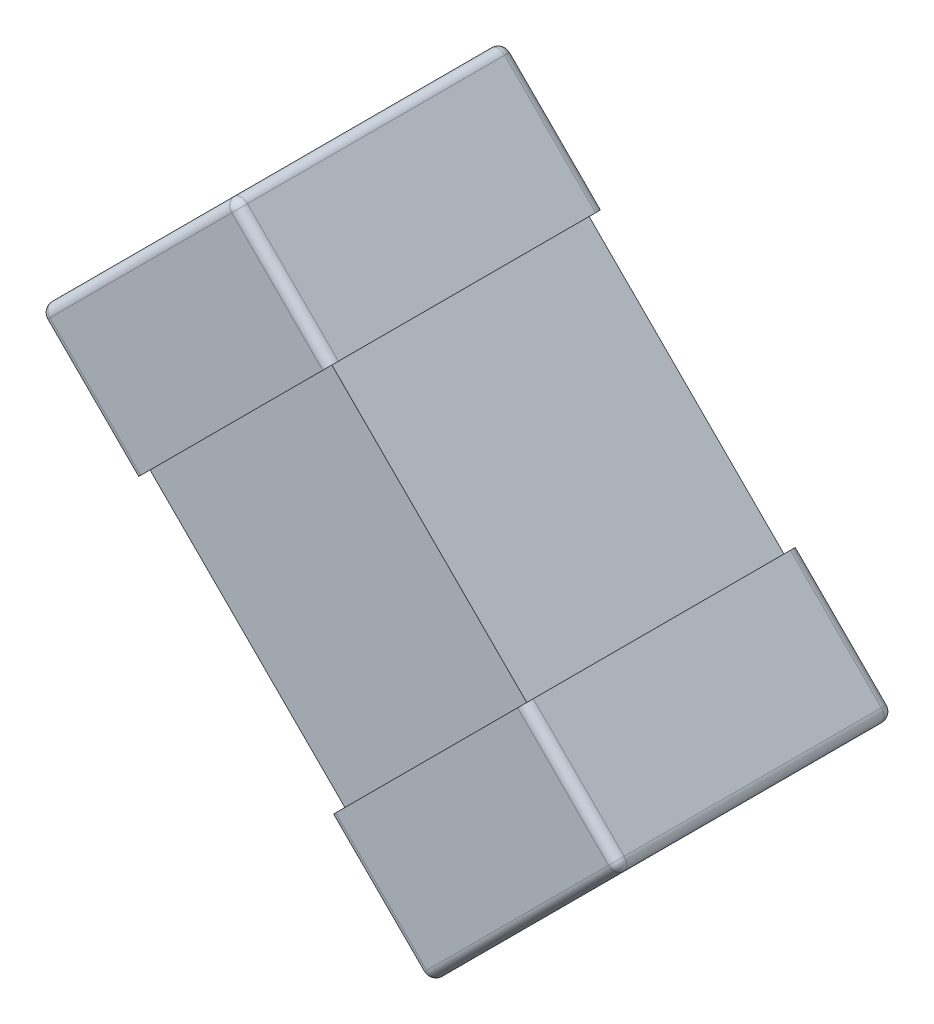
ISO-10303-21;
HEADER;
FILE_DESCRIPTION(('STEP AP214'),'2;1');
FILE_NAME('part.step','',(''),(''),'','','');
FILE_SCHEMA(('AUTOMOTIVE_DESIGN { 1 0 10303 214 1 1 1 1 }'));
ENDSEC;
DATA;
#1=APPLICATION_CONTEXT('core data for automotive mechanical design processes');
#2=APPLICATION_PROTOCOL_DEFINITION('international standard','automotive_design',2000,#1);
#3=PRODUCT_CONTEXT('',#1,'mechanical');
#4=PRODUCT('Part','Part','',(#3));
#5=PRODUCT_RELATED_PRODUCT_CATEGORY('part','',(#4));
#6=PRODUCT_DEFINITION_FORMATION('','',#4);
#7=PRODUCT_DEFINITION_CONTEXT('part definition',#1,'design');
#8=PRODUCT_DEFINITION('design','',#6,#7);
#9=PRODUCT_DEFINITION_SHAPE('','',#8);
#10=(LENGTH_UNIT() NAMED_UNIT(*) SI_UNIT(.MILLI.,.METRE.));
#11=(NAMED_UNIT(*) PLANE_ANGLE_UNIT() SI_UNIT($,.RADIAN.));
#12=(NAMED_UNIT(*) SI_UNIT($,.STERADIAN.) SOLID_ANGLE_UNIT());
#13=UNCERTAINTY_MEASURE_WITH_UNIT(LENGTH_MEASURE(1.E-05),#10,'distance_accuracy_value','');
#14=(GEOMETRIC_REPRESENTATION_CONTEXT(3) GLOBAL_UNCERTAINTY_ASSIGNED_CONTEXT((#13)) GLOBAL_UNIT_ASSIGNED_CONTEXT((#10,
#11,#12)) REPRESENTATION_CONTEXT('',''));
#15=CARTESIAN_POINT('',(0.,0.,0.));
#16=DIRECTION('',(0.,0.,1.));
#17=DIRECTION('',(1.,0.,0.));
#18=AXIS2_PLACEMENT_3D('',#15,#16,#17);
#19=CARTESIAN_POINT('',(12.036066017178,8.84180194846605,0.01));
#20=DIRECTION('',(-0.707106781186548,0.707106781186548,0.));
#21=DIRECTION('',(-0.707106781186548,-0.707106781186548,0.));
#22=AXIS2_PLACEMENT_3D('',#19,#20,#21);
#23=PLANE('',#22);
#24=DIRECTION('',(0.,0.,-1.));
#25=VECTOR('',#24,1.);
#26=CARTESIAN_POINT('',(12.2411269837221,9.04686291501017,0.01));
#27=LINE('',#26,#25);
#28=CARTESIAN_POINT('',(12.2411269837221,9.04686291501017,0.3));
#29=VERTEX_POINT('',#28);
#30=CARTESIAN_POINT('',(12.2411269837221,9.04686291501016,0.0199999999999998));
#31=VERTEX_POINT('',#30);
#32=EDGE_CURVE('E414',#29,#31,#27,.T.);
#33=ORIENTED_EDGE('',*,*,#32,.F.);
#34=DIRECTION('',(-0.707106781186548,-0.707106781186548,0.));
#35=VECTOR('',#34,1.);
#36=CARTESIAN_POINT('',(12.036066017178,8.84180194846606,0.3));
#37=LINE('',#36,#35);
#38=CARTESIAN_POINT('',(12.0431370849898,8.84887301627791,0.3));
#39=VERTEX_POINT('',#38);
#40=EDGE_CURVE('E516',#39,#29,#37,.F.);
#41=ORIENTED_EDGE('',*,*,#40,.F.);
#42=DIRECTION('',(0.,0.,1.));
#43=VECTOR('',#42,1.);
#44=CARTESIAN_POINT('',(12.0431370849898,8.84887301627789,0.31));
#45=LINE('',#44,#43);
#46=CARTESIAN_POINT('',(12.0431370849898,8.8488730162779,0.0200000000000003));
#47=VERTEX_POINT('',#46);
#48=EDGE_CURVE('E447',#47,#39,#45,.T.);
#49=ORIENTED_EDGE('',*,*,#48,.F.);
#50=DIRECTION('',(-0.707106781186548,-0.707106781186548,0.));
#51=VECTOR('',#50,1.);
#52=CARTESIAN_POINT('',(12.036066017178,8.84180194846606,0.02));
#53=LINE('',#52,#51);
#54=EDGE_CURVE('E507',#31,#47,#53,.T.);
#55=ORIENTED_EDGE('',*,*,#54,.F.);
#56=EDGE_LOOP('',(#33,#41,#49,#55));
#57=FACE_BOUND('',#56,.T.);
#58=ADVANCED_FACE('F17',(#57),#23,.F.);
#59=CARTESIAN_POINT('',(11.6118019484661,9.26606601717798,0.01));
#60=DIRECTION('',(0.707106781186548,-0.707106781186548,0.));
#61=DIRECTION('',(0.707106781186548,0.707106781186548,0.));
#62=AXIS2_PLACEMENT_3D('',#59,#60,#61);
#63=PLANE('',#62);
#64=DIRECTION('',(0.,0.,1.));
#65=VECTOR('',#64,1.);
#66=CARTESIAN_POINT('',(11.6188730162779,9.27313708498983,0.31));
#67=LINE('',#66,#65);
#68=CARTESIAN_POINT('',(11.6188730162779,9.27313708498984,0.3));
#69=VERTEX_POINT('',#68);
#70=CARTESIAN_POINT('',(11.6188730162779,9.27313708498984,0.0200000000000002));
#71=VERTEX_POINT('',#70);
#72=EDGE_CURVE('E364',#69,#71,#67,.F.);
#73=ORIENTED_EDGE('',*,*,#72,.F.);
#74=DIRECTION('',(-0.707106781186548,-0.707106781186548,0.));
#75=VECTOR('',#74,1.);
#76=CARTESIAN_POINT('',(11.611801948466,9.26606601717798,0.3));
#77=LINE('',#76,#75);
#78=CARTESIAN_POINT('',(11.8168629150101,9.4711269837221,0.3));
#79=VERTEX_POINT('',#78);
#80=EDGE_CURVE('E488',#79,#69,#77,.T.);
#81=ORIENTED_EDGE('',*,*,#80,.F.);
#82=DIRECTION('',(0.,0.,-1.));
#83=VECTOR('',#82,1.);
#84=CARTESIAN_POINT('',(11.8168629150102,9.47112698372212,0.01));
#85=LINE('',#84,#83);
#86=CARTESIAN_POINT('',(11.8168629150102,9.47112698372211,0.02));
#87=VERTEX_POINT('',#86);
#88=EDGE_CURVE('E304',#87,#79,#85,.F.);
#89=ORIENTED_EDGE('',*,*,#88,.F.);
#90=DIRECTION('',(-0.707106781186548,-0.707106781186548,0.));
#91=VECTOR('',#90,1.);
#92=CARTESIAN_POINT('',(11.611801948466,9.26606601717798,0.02));
#93=LINE('',#92,#91);
#94=EDGE_CURVE('E497',#71,#87,#93,.F.);
#95=ORIENTED_EDGE('',*,*,#94,.F.);
#96=EDGE_LOOP('',(#73,#81,#89,#95));
#97=FACE_BOUND('',#96,.T.);
#98=ADVANCED_FACE('F477',(#97),#63,.F.);
#99=CARTESIAN_POINT('',(12.2340559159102,9.05393398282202,0.3));
#100=DIRECTION('',(-0.707106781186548,0.707106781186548,0.));
#101=DIRECTION('',(0.,0.,-1.));
#102=AXIS2_PLACEMENT_3D('',#99,#100,#101);
#103=SPHERICAL_SURFACE('',#102,0.01);
#104=CARTESIAN_POINT('',(12.2340559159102,9.05393398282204,0.3));
#105=DIRECTION('',(-0.707106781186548,-0.707106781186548,0.));
#106=DIRECTION('',(0.707106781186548,-0.707106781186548,0.));
#107=AXIS2_PLACEMENT_3D('',#104,#105,#106);
#108=CIRCLE('',#107,0.01);
#109=CARTESIAN_POINT('',(12.2340559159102,9.05393398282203,0.31));
#110=VERTEX_POINT('',#109);
#111=EDGE_CURVE('E519',#29,#110,#108,.T.);
#112=ORIENTED_EDGE('',*,*,#111,.F.);
#113=CARTESIAN_POINT('',(12.2340559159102,9.05393398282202,0.3));
#114=DIRECTION('',(0.,0.,-1.));
#115=DIRECTION('',(-1.,0.,0.));
#116=AXIS2_PLACEMENT_3D('',#113,#114,#115);
#117=CIRCLE('',#116,0.01);
#118=CARTESIAN_POINT('',(12.2411269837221,9.06100505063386,0.3));
#119=VERTEX_POINT('',#118);
#120=EDGE_CURVE('E401',#119,#29,#117,.T.);
#121=ORIENTED_EDGE('',*,*,#120,.F.);
#122=CARTESIAN_POINT('',(12.2340559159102,9.05393398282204,0.3));
#123=DIRECTION('',(0.707106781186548,-0.707106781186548,0.));
#124=DIRECTION('',(0.707106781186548,0.707106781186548,0.));
#125=AXIS2_PLACEMENT_3D('',#122,#123,#124);
#126=CIRCLE('',#125,0.01);
#127=EDGE_CURVE('E196',#110,#119,#126,.F.);
#128=ORIENTED_EDGE('',*,*,#127,.F.);
#129=EDGE_LOOP('',(#112,#121,#128));
#130=FACE_BOUND('',#129,.T.);
#131=ADVANCED_FACE('F473',(#130),#103,.T.);
#132=CARTESIAN_POINT('',(12.0289949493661,8.84887301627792,0.3));
#133=DIRECTION('',(-0.707106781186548,-0.707106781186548,0.));
#134=DIRECTION('',(0.707106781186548,-0.707106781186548,0.));
#135=AXIS2_PLACEMENT_3D('',#132,#133,#134);
#136=CYLINDRICAL_SURFACE('',#135,0.01);
#137=ORIENTED_EDGE('',*,*,#111,.T.);
#138=DIRECTION('',(-0.707106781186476,-0.707106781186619,0.));
#139=VECTOR('',#138,1.);
#140=CARTESIAN_POINT('',(12.2340559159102,9.05393398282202,0.31));
#141=LINE('',#140,#139);
#142=CARTESIAN_POINT('',(12.0360660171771,8.85594408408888,0.31));
#143=VERTEX_POINT('',#142);
#144=EDGE_CURVE('E195',#110,#143,#141,.T.);
#145=ORIENTED_EDGE('',*,*,#144,.T.);
#146=CARTESIAN_POINT('',(12.036066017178,8.85594408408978,0.3));
#147=DIRECTION('',(0.707106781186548,0.707106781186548,5.16518506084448E-10));
#148=DIRECTION('',(-0.707106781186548,0.707106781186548,0.));
#149=AXIS2_PLACEMENT_3D('',#146,#147,#148);
#150=CIRCLE('',#149,0.01);
#151=EDGE_CURVE('E457',#39,#143,#150,.F.);
#152=ORIENTED_EDGE('',*,*,#151,.F.);
#153=ORIENTED_EDGE('',*,*,#40,.T.);
#154=EDGE_LOOP('',(#137,#145,#152,#153));
#155=FACE_BOUND('',#154,.T.);
#156=ADVANCED_FACE('F469',(#155),#136,.T.);
#157=CARTESIAN_POINT('',(12.036066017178,8.85594408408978,0.3));
#158=DIRECTION('',(-0.707106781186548,0.707106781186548,0.));
#159=DIRECTION('',(0.,0.,-1.));
#160=AXIS2_PLACEMENT_3D('',#157,#158,#159);
#161=SPHERICAL_SURFACE('',#160,0.01);
#162=CARTESIAN_POINT('',(12.036066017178,8.85594408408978,0.3));
#163=DIRECTION('',(0.,0.,1.));
#164=DIRECTION('',(1.,0.,0.));
#165=AXIS2_PLACEMENT_3D('',#162,#163,#164);
#166=CIRCLE('',#165,0.01);
#167=CARTESIAN_POINT('',(12.0289949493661,8.84887301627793,0.3));
#168=VERTEX_POINT('',#167);
#169=EDGE_CURVE('E454',#39,#168,#166,.F.);
#170=ORIENTED_EDGE('',*,*,#169,.F.);
#171=ORIENTED_EDGE('',*,*,#151,.T.);
#172=CARTESIAN_POINT('',(12.0360660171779,8.85594408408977,0.3));
#173=DIRECTION('',(-0.707106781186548,0.707106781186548,0.));
#174=DIRECTION('',(-0.707106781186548,-0.707106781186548,0.));
#175=AXIS2_PLACEMENT_3D('',#172,#173,#174);
#176=CIRCLE('',#175,0.01);
#177=EDGE_CURVE('E292',#168,#143,#176,.T.);
#178=ORIENTED_EDGE('',*,*,#177,.F.);
#179=EDGE_LOOP('',(#170,#171,#178));
#180=FACE_BOUND('',#179,.T.);
#181=ADVANCED_FACE('F466',(#180),#161,.T.);
#182=CARTESIAN_POINT('',(12.036066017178,8.85594408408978,0.31));
#183=DIRECTION('',(0.,0.,1.));
#184=DIRECTION('',(1.,0.,0.));
#185=AXIS2_PLACEMENT_3D('',#182,#183,#184);
#186=CYLINDRICAL_SURFACE('',#185,0.01);
#187=CARTESIAN_POINT('',(12.036066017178,8.85594408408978,0.0200000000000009));
#188=DIRECTION('',(0.,0.,1.));
#189=DIRECTION('',(-0.707106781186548,0.707106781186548,0.));
#190=AXIS2_PLACEMENT_3D('',#187,#188,#189);
#191=CIRCLE('',#190,0.01);
#192=CARTESIAN_POINT('',(12.0289949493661,8.84887301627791,0.0200000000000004));
#193=VERTEX_POINT('',#192);
#194=EDGE_CURVE('E443',#47,#193,#191,.F.);
#195=ORIENTED_EDGE('',*,*,#194,.F.);
#196=ORIENTED_EDGE('',*,*,#48,.T.);
#197=ORIENTED_EDGE('',*,*,#169,.T.);
#198=DIRECTION('',(0.,0.,1.));
#199=VECTOR('',#198,1.);
#200=CARTESIAN_POINT('',(12.0289949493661,8.84887301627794,0.31));
#201=LINE('',#200,#199);
#202=EDGE_CURVE('E287',#193,#168,#201,.T.);
#203=ORIENTED_EDGE('',*,*,#202,.F.);
#204=EDGE_LOOP('',(#195,#196,#197,#203));
#205=FACE_BOUND('',#204,.T.);
#206=ADVANCED_FACE('F435',(#205),#186,.T.);
#207=CARTESIAN_POINT('',(12.036066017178,8.85594408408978,0.02));
#208=DIRECTION('',(-0.707106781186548,0.707106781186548,0.));
#209=DIRECTION('',(0.,0.,-1.));
#210=AXIS2_PLACEMENT_3D('',#207,#208,#209);
#211=SPHERICAL_SURFACE('',#210,0.01);
#212=CARTESIAN_POINT('',(12.036066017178,8.85594408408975,0.0200000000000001));
#213=DIRECTION('',(0.707106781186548,-0.707106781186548,0.));
#214=DIRECTION('',(0.707106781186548,0.707106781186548,0.));
#215=AXIS2_PLACEMENT_3D('',#212,#213,#214);
#216=CIRCLE('',#215,0.01);
#217=CARTESIAN_POINT('',(12.036066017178,8.85594408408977,0.01));
#218=VERTEX_POINT('',#217);
#219=EDGE_CURVE('E281',#218,#193,#216,.F.);
#220=ORIENTED_EDGE('',*,*,#219,.F.);
#221=CARTESIAN_POINT('',(12.0360660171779,8.85594408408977,0.02));
#222=DIRECTION('',(-0.707106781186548,-0.707106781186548,0.));
#223=DIRECTION('',(0.707106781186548,-0.707106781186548,0.));
#224=AXIS2_PLACEMENT_3D('',#221,#222,#223);
#225=CIRCLE('',#224,0.01);
#226=EDGE_CURVE('E446',#47,#218,#225,.F.);
#227=ORIENTED_EDGE('',*,*,#226,.F.);
#228=ORIENTED_EDGE('',*,*,#194,.T.);
#229=EDGE_LOOP('',(#220,#227,#228));
#230=FACE_BOUND('',#229,.T.);
#231=ADVANCED_FACE('F430',(#230),#211,.T.);
#232=CARTESIAN_POINT('',(12.0289949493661,8.84887301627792,0.02));
#233=DIRECTION('',(-0.707106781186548,-0.707106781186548,0.));
#234=DIRECTION('',(0.707106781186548,-0.707106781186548,0.));
#235=AXIS2_PLACEMENT_3D('',#232,#233,#234);
#236=CYLINDRICAL_SURFACE('',#235,0.01);
#237=CARTESIAN_POINT('',(12.2340559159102,9.05393398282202,0.02));
#238=DIRECTION('',(-0.707106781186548,-0.707106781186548,0.));
#239=DIRECTION('',(-0.707106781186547,0.707106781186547,0.));
#240=AXIS2_PLACEMENT_3D('',#237,#238,#239);
#241=CIRCLE('',#240,0.01);
#242=CARTESIAN_POINT('',(12.2340559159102,9.05393398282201,0.01));
#243=VERTEX_POINT('',#242);
#244=EDGE_CURVE('E402',#31,#243,#241,.F.);
#245=ORIENTED_EDGE('',*,*,#244,.F.);
#246=ORIENTED_EDGE('',*,*,#54,.T.);
#247=ORIENTED_EDGE('',*,*,#226,.T.);
#248=DIRECTION('',(0.707106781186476,0.707106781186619,0.));
#249=VECTOR('',#248,1.);
#250=CARTESIAN_POINT('',(12.036066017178,8.85594408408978,0.01));
#251=LINE('',#250,#249);
#252=EDGE_CURVE('E275',#218,#243,#251,.T.);
#253=ORIENTED_EDGE('',*,*,#252,.T.);
#254=EDGE_LOOP('',(#245,#246,#247,#253));
#255=FACE_BOUND('',#254,.T.);
#256=ADVANCED_FACE('F426',(#255),#236,.T.);
#257=CARTESIAN_POINT('',(12.2340559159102,9.05393398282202,0.02));
#258=DIRECTION('',(-0.707106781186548,0.707106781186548,0.));
#259=DIRECTION('',(0.,0.,-1.));
#260=AXIS2_PLACEMENT_3D('',#257,#258,#259);
#261=SPHERICAL_SURFACE('',#260,0.01);
#262=CARTESIAN_POINT('',(12.2340559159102,9.05393398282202,0.02));
#263=DIRECTION('',(-0.707106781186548,0.707106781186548,0.));
#264=DIRECTION('',(-0.707106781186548,-0.707106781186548,0.));
#265=AXIS2_PLACEMENT_3D('',#262,#263,#264);
#266=CIRCLE('',#265,0.01);
#267=CARTESIAN_POINT('',(12.2411269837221,9.06100505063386,0.0199999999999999));
#268=VERTEX_POINT('',#267);
#269=EDGE_CURVE('E269',#268,#243,#266,.T.);
#270=ORIENTED_EDGE('',*,*,#269,.F.);
#271=CARTESIAN_POINT('',(12.2340559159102,9.05393398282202,0.02));
#272=DIRECTION('',(0.,0.,-1.));
#273=DIRECTION('',(-1.,0.,0.));
#274=AXIS2_PLACEMENT_3D('',#271,#272,#273);
#275=CIRCLE('',#274,0.01);
#276=EDGE_CURVE('E398',#31,#268,#275,.F.);
#277=ORIENTED_EDGE('',*,*,#276,.F.);
#278=ORIENTED_EDGE('',*,*,#244,.T.);
#279=EDGE_LOOP('',(#270,#277,#278));
#280=FACE_BOUND('',#279,.T.);
#281=ADVANCED_FACE('F423',(#280),#261,.T.);
#282=CARTESIAN_POINT('',(12.2340559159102,9.05393398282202,0.01));
#283=DIRECTION('',(0.,0.,-1.));
#284=DIRECTION('',(-1.,0.,0.));
#285=AXIS2_PLACEMENT_3D('',#282,#283,#284);
#286=CYLINDRICAL_SURFACE('',#285,0.01);
#287=ORIENTED_EDGE('',*,*,#120,.T.);
#288=ORIENTED_EDGE('',*,*,#32,.T.);
#289=ORIENTED_EDGE('',*,*,#276,.T.);
#290=DIRECTION('',(0.,0.,1.));
#291=VECTOR('',#290,1.);
#292=CARTESIAN_POINT('',(12.2411269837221,9.06100505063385,0.31));
#293=LINE('',#292,#291);
#294=EDGE_CURVE('E260',#268,#119,#293,.T.);
#295=ORIENTED_EDGE('',*,*,#294,.T.);
#296=EDGE_LOOP('',(#287,#288,#289,#295));
#297=FACE_BOUND('',#296,.T.);
#298=ADVANCED_FACE('F386',(#297),#286,.T.);
#299=CARTESIAN_POINT('',(11.823933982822,9.46405591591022,0.02));
#300=DIRECTION('',(0.707106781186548,-0.707106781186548,0.));
#301=DIRECTION('',(0.,0.,-1.));
#302=AXIS2_PLACEMENT_3D('',#299,#300,#301);
#303=SPHERICAL_SURFACE('',#302,0.01);
#304=CARTESIAN_POINT('',(11.823933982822,9.46405591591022,0.02));
#305=DIRECTION('',(0.,0.,-1.));
#306=DIRECTION('',(-1.,0.,0.));
#307=AXIS2_PLACEMENT_3D('',#304,#305,#306);
#308=CIRCLE('',#307,0.01);
#309=CARTESIAN_POINT('',(11.8310050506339,9.47112698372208,0.0199999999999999));
#310=VERTEX_POINT('',#309);
#311=EDGE_CURVE('E315',#310,#87,#308,.F.);
#312=ORIENTED_EDGE('',*,*,#311,.F.);
#313=CARTESIAN_POINT('',(11.823933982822,9.46405591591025,0.02));
#314=DIRECTION('',(0.707106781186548,-0.707106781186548,0.));
#315=DIRECTION('',(0.707106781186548,0.707106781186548,0.));
#316=AXIS2_PLACEMENT_3D('',#313,#314,#315);
#317=CIRCLE('',#316,0.01);
#318=CARTESIAN_POINT('',(11.823933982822,9.46405591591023,0.01));
#319=VERTEX_POINT('',#318);
#320=EDGE_CURVE('E254',#319,#310,#317,.T.);
#321=ORIENTED_EDGE('',*,*,#320,.F.);
#322=CARTESIAN_POINT('',(11.823933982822,9.46405591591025,0.02));
#323=DIRECTION('',(-0.707106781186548,-0.707106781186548,0.));
#324=DIRECTION('',(0.707106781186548,-0.707106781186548,0.));
#325=AXIS2_PLACEMENT_3D('',#322,#323,#324);
#326=CIRCLE('',#325,0.01);
#327=EDGE_CURVE('E500',#87,#319,#326,.T.);
#328=ORIENTED_EDGE('',*,*,#327,.F.);
#329=EDGE_LOOP('',(#312,#321,#328));
#330=FACE_BOUND('',#329,.T.);
#331=ADVANCED_FACE('F381',(#330),#303,.T.);
#332=CARTESIAN_POINT('',(11.6188730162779,9.25899494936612,0.02));
#333=DIRECTION('',(-0.707106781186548,-0.707106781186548,0.));
#334=DIRECTION('',(0.707106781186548,-0.707106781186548,0.));
#335=AXIS2_PLACEMENT_3D('',#332,#333,#334);
#336=CYLINDRICAL_SURFACE('',#335,0.01);
#337=ORIENTED_EDGE('',*,*,#327,.T.);
#338=DIRECTION('',(-0.707106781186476,-0.707106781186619,0.));
#339=VECTOR('',#338,1.);
#340=CARTESIAN_POINT('',(11.823933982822,9.46405591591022,0.01));
#341=LINE('',#340,#339);
#342=CARTESIAN_POINT('',(11.6259440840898,9.26606601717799,0.0100000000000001));
#343=VERTEX_POINT('',#342);
#344=EDGE_CURVE('E253',#319,#343,#341,.T.);
#345=ORIENTED_EDGE('',*,*,#344,.T.);
#346=CARTESIAN_POINT('',(11.6259440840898,9.26606601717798,0.02));
#347=DIRECTION('',(0.707106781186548,0.707106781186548,0.));
#348=DIRECTION('',(0.707106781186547,-0.707106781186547,0.));
#349=AXIS2_PLACEMENT_3D('',#346,#347,#348);
#350=CIRCLE('',#349,0.01);
#351=EDGE_CURVE('E372',#71,#343,#350,.F.);
#352=ORIENTED_EDGE('',*,*,#351,.F.);
#353=ORIENTED_EDGE('',*,*,#94,.T.);
#354=EDGE_LOOP('',(#337,#345,#352,#353));
#355=FACE_BOUND('',#354,.T.);
#356=ADVANCED_FACE('F377',(#355),#336,.T.);
#357=CARTESIAN_POINT('',(11.6259440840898,9.26606601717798,0.02));
#358=DIRECTION('',(0.707106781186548,-0.707106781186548,0.));
#359=DIRECTION('',(0.,0.,-1.));
#360=AXIS2_PLACEMENT_3D('',#357,#358,#359);
#361=SPHERICAL_SURFACE('',#360,0.01);
#362=ORIENTED_EDGE('',*,*,#351,.T.);
#363=CARTESIAN_POINT('',(11.6259440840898,9.26606601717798,0.0200000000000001));
#364=DIRECTION('',(-0.707106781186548,0.707106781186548,0.));
#365=DIRECTION('',(-0.707106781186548,-0.707106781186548,0.));
#366=AXIS2_PLACEMENT_3D('',#363,#364,#365);
#367=CIRCLE('',#366,0.01);
#368=CARTESIAN_POINT('',(11.6188730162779,9.25899494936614,0.02));
#369=VERTEX_POINT('',#368);
#370=EDGE_CURVE('E247',#369,#343,#367,.F.);
#371=ORIENTED_EDGE('',*,*,#370,.F.);
#372=CARTESIAN_POINT('',(11.6259440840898,9.26606601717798,0.02));
#373=DIRECTION('',(0.,0.,1.));
#374=DIRECTION('',(1.,0.,0.));
#375=AXIS2_PLACEMENT_3D('',#372,#373,#374);
#376=CIRCLE('',#375,0.01);
#377=EDGE_CURVE('E355',#71,#369,#376,.T.);
#378=ORIENTED_EDGE('',*,*,#377,.F.);
#379=EDGE_LOOP('',(#362,#371,#378));
#380=FACE_BOUND('',#379,.T.);
#381=ADVANCED_FACE('F374',(#380),#361,.T.);
#382=CARTESIAN_POINT('',(11.6259440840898,9.26606601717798,0.31));
#383=DIRECTION('',(0.,0.,1.));
#384=DIRECTION('',(1.,0.,0.));
#385=AXIS2_PLACEMENT_3D('',#382,#383,#384);
#386=CYLINDRICAL_SURFACE('',#385,0.01);
#387=ORIENTED_EDGE('',*,*,#377,.T.);
#388=DIRECTION('',(0.,0.,1.));
#389=VECTOR('',#388,1.);
#390=CARTESIAN_POINT('',(11.6188730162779,9.25899494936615,0.31));
#391=LINE('',#390,#389);
#392=CARTESIAN_POINT('',(11.6188730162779,9.25899494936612,0.299999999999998));
#393=VERTEX_POINT('',#392);
#394=EDGE_CURVE('E241',#393,#369,#391,.F.);
#395=ORIENTED_EDGE('',*,*,#394,.F.);
#396=CARTESIAN_POINT('',(11.6259440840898,9.26606601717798,0.3));
#397=DIRECTION('',(4.74675854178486E-13,4.74675854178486E-13,-1.));
#398=DIRECTION('',(0.707106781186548,-0.707106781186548,0.));
#399=AXIS2_PLACEMENT_3D('',#396,#397,#398);
#400=CIRCLE('',#399,0.01);
#401=EDGE_CURVE('E351',#69,#393,#400,.F.);
#402=ORIENTED_EDGE('',*,*,#401,.F.);
#403=ORIENTED_EDGE('',*,*,#72,.T.);
#404=EDGE_LOOP('',(#387,#395,#402,#403));
#405=FACE_BOUND('',#404,.T.);
#406=ADVANCED_FACE('F343',(#405),#386,.T.);
#407=CARTESIAN_POINT('',(11.6259440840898,9.26606601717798,0.3));
#408=DIRECTION('',(0.707106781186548,-0.707106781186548,0.));
#409=DIRECTION('',(0.,0.,-1.));
#410=AXIS2_PLACEMENT_3D('',#407,#408,#409);
#411=SPHERICAL_SURFACE('',#410,0.01);
#412=CARTESIAN_POINT('',(11.6259440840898,9.26606601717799,0.3));
#413=DIRECTION('',(-0.707106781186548,-0.707106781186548,0.));
#414=DIRECTION('',(0.707106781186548,-0.707106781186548,0.));
#415=AXIS2_PLACEMENT_3D('',#412,#413,#414);
#416=CIRCLE('',#415,0.01);
#417=CARTESIAN_POINT('',(11.6259440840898,9.26606601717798,0.31));
#418=VERTEX_POINT('',#417);
#419=EDGE_CURVE('E354',#69,#418,#416,.F.);
#420=ORIENTED_EDGE('',*,*,#419,.F.);
#421=ORIENTED_EDGE('',*,*,#401,.T.);
#422=CARTESIAN_POINT('',(11.6259440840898,9.26606601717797,0.3));
#423=DIRECTION('',(0.707106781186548,-0.707106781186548,0.));
#424=DIRECTION('',(0.707106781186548,0.707106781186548,0.));
#425=AXIS2_PLACEMENT_3D('',#422,#423,#424);
#426=CIRCLE('',#425,0.01);
#427=EDGE_CURVE('E235',#418,#393,#426,.T.);
#428=ORIENTED_EDGE('',*,*,#427,.F.);
#429=EDGE_LOOP('',(#420,#421,#428));
#430=FACE_BOUND('',#429,.T.);
#431=ADVANCED_FACE('F338',(#430),#411,.T.);
#432=CARTESIAN_POINT('',(11.6188730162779,9.25899494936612,0.3));
#433=DIRECTION('',(-0.707106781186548,-0.707106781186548,0.));
#434=DIRECTION('',(0.707106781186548,-0.707106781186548,0.));
#435=AXIS2_PLACEMENT_3D('',#432,#433,#434);
#436=CYLINDRICAL_SURFACE('',#435,0.01);
#437=CARTESIAN_POINT('',(11.823933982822,9.46405591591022,0.3));
#438=DIRECTION('',(-0.707106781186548,-0.707106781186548,5.16518506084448E-10));
#439=DIRECTION('',(0.707106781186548,-0.707106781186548,0.));
#440=AXIS2_PLACEMENT_3D('',#437,#438,#439);
#441=CIRCLE('',#440,0.01);
#442=CARTESIAN_POINT('',(11.8239339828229,9.46405591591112,0.31));
#443=VERTEX_POINT('',#442);
#444=EDGE_CURVE('E318',#79,#443,#441,.F.);
#445=ORIENTED_EDGE('',*,*,#444,.F.);
#446=ORIENTED_EDGE('',*,*,#80,.T.);
#447=ORIENTED_EDGE('',*,*,#419,.T.);
#448=DIRECTION('',(0.707106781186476,0.707106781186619,0.));
#449=VECTOR('',#448,1.);
#450=CARTESIAN_POINT('',(11.6259440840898,9.26606601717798,0.31));
#451=LINE('',#450,#449);
#452=EDGE_CURVE('E229',#418,#443,#451,.T.);
#453=ORIENTED_EDGE('',*,*,#452,.T.);
#454=EDGE_LOOP('',(#445,#446,#447,#453));
#455=FACE_BOUND('',#454,.T.);
#456=ADVANCED_FACE('F333',(#455),#436,.T.);
#457=CARTESIAN_POINT('',(11.823933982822,9.46405591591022,0.3));
#458=DIRECTION('',(0.707106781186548,-0.707106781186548,0.));
#459=DIRECTION('',(0.,0.,-1.));
#460=AXIS2_PLACEMENT_3D('',#457,#458,#459);
#461=SPHERICAL_SURFACE('',#460,0.01);
#462=CARTESIAN_POINT('',(11.823933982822,9.46405591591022,0.3));
#463=DIRECTION('',(0.,0.,-1.));
#464=DIRECTION('',(-1.,0.,0.));
#465=AXIS2_PLACEMENT_3D('',#462,#463,#464);
#466=CIRCLE('',#465,0.01);
#467=CARTESIAN_POINT('',(11.8310050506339,9.47112698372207,0.3));
#468=VERTEX_POINT('',#467);
#469=EDGE_CURVE('E301',#79,#468,#466,.T.);
#470=ORIENTED_EDGE('',*,*,#469,.F.);
#471=ORIENTED_EDGE('',*,*,#444,.T.);
#472=CARTESIAN_POINT('',(11.8239339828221,9.46405591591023,0.3));
#473=DIRECTION('',(-0.707106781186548,0.707106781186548,0.));
#474=DIRECTION('',(-0.707106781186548,-0.707106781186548,0.));
#475=AXIS2_PLACEMENT_3D('',#472,#473,#474);
#476=CIRCLE('',#475,0.01);
#477=EDGE_CURVE('E223',#468,#443,#476,.F.);
#478=ORIENTED_EDGE('',*,*,#477,.F.);
#479=EDGE_LOOP('',(#470,#471,#478));
#480=FACE_BOUND('',#479,.T.);
#481=ADVANCED_FACE('F328',(#480),#461,.T.);
#482=CARTESIAN_POINT('',(11.823933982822,9.46405591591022,0.01));
#483=DIRECTION('',(0.,0.,-1.));
#484=DIRECTION('',(-1.,0.,0.));
#485=AXIS2_PLACEMENT_3D('',#482,#483,#484);
#486=CYLINDRICAL_SURFACE('',#485,0.01);
#487=ORIENTED_EDGE('',*,*,#469,.T.);
#488=DIRECTION('',(0.,0.,1.));
#489=VECTOR('',#488,1.);
#490=CARTESIAN_POINT('',(11.8310050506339,9.47112698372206,0.31));
#491=LINE('',#490,#489);
#492=EDGE_CURVE('E210',#468,#310,#491,.F.);
#493=ORIENTED_EDGE('',*,*,#492,.T.);
#494=ORIENTED_EDGE('',*,*,#311,.T.);
#495=ORIENTED_EDGE('',*,*,#88,.T.);
#496=EDGE_LOOP('',(#487,#493,#494,#495));
#497=FACE_BOUND('',#496,.T.);
#498=ADVANCED_FACE('F332',(#497),#486,.T.);
#499=CARTESIAN_POINT('',(12.2411269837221,9.04686291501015,0.3));
#500=DIRECTION('',(0.707106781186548,-0.707106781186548,0.));
#501=DIRECTION('',(0.707106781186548,0.707106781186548,0.));
#502=AXIS2_PLACEMENT_3D('',#499,#500,#501);
#503=CYLINDRICAL_SURFACE('',#502,0.01);
#504=ORIENTED_EDGE('',*,*,#127,.T.);
#505=DIRECTION('',(0.707106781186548,-0.707106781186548,0.));
#506=VECTOR('',#505,1.);
#507=CARTESIAN_POINT('',(12.2481980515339,9.05393398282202,0.3));
#508=LINE('',#507,#506);
#509=CARTESIAN_POINT('',(12.142132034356,9.15999999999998,0.3));
#510=VERTEX_POINT('',#509);
#511=EDGE_CURVE('E177',#119,#510,#508,.F.);
#512=ORIENTED_EDGE('',*,*,#511,.T.);
#513=CARTESIAN_POINT('',(12.1350609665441,9.15292893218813,0.3));
#514=DIRECTION('',(0.707106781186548,-0.707106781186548,0.));
#515=DIRECTION('',(0.707106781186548,0.707106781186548,0.));
#516=AXIS2_PLACEMENT_3D('',#513,#514,#515);
#517=CIRCLE('',#516,0.01);
#518=CARTESIAN_POINT('',(12.1350609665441,9.15292893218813,0.31));
#519=VERTEX_POINT('',#518);
#520=EDGE_CURVE('E20',#510,#519,#517,.T.);
#521=ORIENTED_EDGE('',*,*,#520,.T.);
#522=DIRECTION('',(0.707106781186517,-0.707106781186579,0.));
#523=VECTOR('',#522,1.);
#524=CARTESIAN_POINT('',(12.1350609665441,9.15292893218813,0.31));
#525=LINE('',#524,#523);
#526=EDGE_CURVE('E183',#519,#110,#525,.T.);
#527=ORIENTED_EDGE('',*,*,#526,.T.);
#528=EDGE_LOOP('',(#504,#512,#521,#527));
#529=FACE_BOUND('',#528,.T.);
#530=ADVANCED_FACE('F182',(#529),#503,.T.);
#531=CARTESIAN_POINT('',(12.036066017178,8.84180194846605,0.31));
#532=DIRECTION('',(0.,0.,-1.));
#533=DIRECTION('',(-1.,0.,0.));
#534=AXIS2_PLACEMENT_3D('',#531,#532,#533);
#535=PLANE('',#534);
#536=ORIENTED_EDGE('',*,*,#526,.F.);
#537=DIRECTION('',(0.707106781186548,0.707106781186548,0.));
#538=VECTOR('',#537,1.);
#539=CARTESIAN_POINT('',(11.93,8.94786796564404,0.31));
#540=LINE('',#539,#538);
#541=CARTESIAN_POINT('',(11.9370710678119,8.95493903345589,0.31));
#542=VERTEX_POINT('',#541);
#543=EDGE_CURVE('E188',#519,#542,#540,.F.);
#544=ORIENTED_EDGE('',*,*,#543,.T.);
#545=DIRECTION('',(-0.707106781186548,0.707106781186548,0.));
#546=VECTOR('',#545,1.);
#547=CARTESIAN_POINT('',(12.0431370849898,8.84887301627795,0.31));
#548=LINE('',#547,#546);
#549=EDGE_CURVE('E290',#143,#542,#548,.T.);
#550=ORIENTED_EDGE('',*,*,#549,.F.);
#551=ORIENTED_EDGE('',*,*,#144,.F.);
#552=EDGE_LOOP('',(#536,#544,#550,#551));
#553=FACE_BOUND('',#552,.T.);
#554=ADVANCED_FACE('F192',(#553),#535,.F.);
#555=CARTESIAN_POINT('',(12.0431370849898,8.84887301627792,0.3));
#556=DIRECTION('',(-0.707106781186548,0.707106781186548,0.));
#557=DIRECTION('',(-0.707106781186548,-0.707106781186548,0.));
#558=AXIS2_PLACEMENT_3D('',#555,#556,#557);
#559=CYLINDRICAL_SURFACE('',#558,0.01);
#560=ORIENTED_EDGE('',*,*,#177,.T.);
#561=ORIENTED_EDGE('',*,*,#549,.T.);
#562=CARTESIAN_POINT('',(11.9370710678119,8.95493903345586,0.3));
#563=DIRECTION('',(-0.707106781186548,0.707106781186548,0.));
#564=DIRECTION('',(-0.707106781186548,-0.707106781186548,0.));
#565=AXIS2_PLACEMENT_3D('',#562,#563,#564);
#566=CIRCLE('',#565,0.01);
#567=CARTESIAN_POINT('',(11.93,8.94786796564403,0.3));
#568=VERTEX_POINT('',#567);
#569=EDGE_CURVE('E202',#542,#568,#566,.F.);
#570=ORIENTED_EDGE('',*,*,#569,.T.);
#571=DIRECTION('',(0.707106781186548,-0.707106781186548,0.));
#572=VECTOR('',#571,1.);
#573=CARTESIAN_POINT('',(12.036066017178,8.84180194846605,0.3));
#574=LINE('',#573,#572);
#575=EDGE_CURVE('E284',#168,#568,#574,.F.);
#576=ORIENTED_EDGE('',*,*,#575,.F.);
#577=EDGE_LOOP('',(#560,#561,#570,#576));
#578=FACE_BOUND('',#577,.T.);
#579=ADVANCED_FACE('F575',(#578),#559,.T.);
#580=CARTESIAN_POINT('',(12.036066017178,8.84180194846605,0.31));
#581=DIRECTION('',(-0.707106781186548,-0.707106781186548,0.));
#582=DIRECTION('',(0.707106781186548,-0.707106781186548,0.));
#583=AXIS2_PLACEMENT_3D('',#580,#581,#582);
#584=PLANE('',#583);
#585=ORIENTED_EDGE('',*,*,#202,.T.);
#586=ORIENTED_EDGE('',*,*,#575,.T.);
#587=DIRECTION('',(0.,0.,1.));
#588=VECTOR('',#587,1.);
#589=CARTESIAN_POINT('',(11.93,8.94786796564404,0.01));
#590=LINE('',#589,#588);
#591=CARTESIAN_POINT('',(11.93,8.94786796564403,0.0200000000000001));
#592=VERTEX_POINT('',#591);
#593=EDGE_CURVE('E204',#568,#592,#590,.F.);
#594=ORIENTED_EDGE('',*,*,#593,.T.);
#595=DIRECTION('',(0.707106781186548,-0.707106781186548,0.));
#596=VECTOR('',#595,1.);
#597=CARTESIAN_POINT('',(12.0360660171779,8.84180194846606,0.0200000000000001));
#598=LINE('',#597,#596);
#599=EDGE_CURVE('E276',#193,#592,#598,.F.);
#600=ORIENTED_EDGE('',*,*,#599,.F.);
#601=EDGE_LOOP('',(#585,#586,#594,#600));
#602=FACE_BOUND('',#601,.T.);
#603=ADVANCED_FACE('F546',(#602),#584,.T.);
#604=CARTESIAN_POINT('',(12.0431370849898,8.84887301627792,0.0200000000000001));
#605=DIRECTION('',(0.707106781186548,-0.707106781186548,0.));
#606=DIRECTION('',(0.707106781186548,0.707106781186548,0.));
#607=AXIS2_PLACEMENT_3D('',#604,#605,#606);
#608=CYLINDRICAL_SURFACE('',#607,0.01);
#609=ORIENTED_EDGE('',*,*,#219,.T.);
#610=ORIENTED_EDGE('',*,*,#599,.T.);
#611=CARTESIAN_POINT('',(11.9370710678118,8.95493903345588,0.0200000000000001));
#612=DIRECTION('',(0.707106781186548,-0.707106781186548,0.));
#613=DIRECTION('',(0.707106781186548,0.707106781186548,0.));
#614=AXIS2_PLACEMENT_3D('',#611,#612,#613);
#615=CIRCLE('',#614,0.01);
#616=CARTESIAN_POINT('',(11.9370710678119,8.9549390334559,0.01));
#617=VERTEX_POINT('',#616);
#618=EDGE_CURVE('E539',#592,#617,#615,.T.);
#619=ORIENTED_EDGE('',*,*,#618,.T.);
#620=DIRECTION('',(0.707106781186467,-0.707106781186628,0.));
#621=VECTOR('',#620,1.);
#622=CARTESIAN_POINT('',(11.9370710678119,8.9549390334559,0.01));
#623=LINE('',#622,#621);
#624=EDGE_CURVE('E272',#617,#218,#623,.T.);
#625=ORIENTED_EDGE('',*,*,#624,.T.);
#626=EDGE_LOOP('',(#609,#610,#619,#625));
#627=FACE_BOUND('',#626,.T.);
#628=ADVANCED_FACE('F549',(#627),#608,.T.);
#629=CARTESIAN_POINT('',(12.036066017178,8.84180194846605,0.01));
#630=DIRECTION('',(0.,0.,1.));
#631=DIRECTION('',(1.,0.,0.));
#632=AXIS2_PLACEMENT_3D('',#629,#630,#631);
#633=PLANE('',#632);
#634=DIRECTION('',(-0.707106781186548,0.707106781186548,0.));
#635=VECTOR('',#634,1.);
#636=CARTESIAN_POINT('',(12.2411269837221,9.04686291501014,0.01));
#637=LINE('',#636,#635);
#638=CARTESIAN_POINT('',(12.1350609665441,9.15292893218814,0.01));
#639=VERTEX_POINT('',#638);
#640=EDGE_CURVE('E264',#243,#639,#637,.T.);
#641=ORIENTED_EDGE('',*,*,#640,.F.);
#642=ORIENTED_EDGE('',*,*,#252,.F.);
#643=ORIENTED_EDGE('',*,*,#624,.F.);
#644=DIRECTION('',(0.707106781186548,0.707106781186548,0.));
#645=VECTOR('',#644,1.);
#646=CARTESIAN_POINT('',(11.93,8.94786796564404,0.01));
#647=LINE('',#646,#645);
#648=EDGE_CURVE('E538',#617,#639,#647,.T.);
#649=ORIENTED_EDGE('',*,*,#648,.T.);
#650=EDGE_LOOP('',(#641,#642,#643,#649));
#651=FACE_BOUND('',#650,.T.);
#652=ADVANCED_FACE('F553',(#651),#633,.F.);
#653=CARTESIAN_POINT('',(12.2411269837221,9.04686291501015,0.02));
#654=DIRECTION('',(-0.707106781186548,0.707106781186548,0.));
#655=DIRECTION('',(-0.707106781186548,-0.707106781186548,0.));
#656=AXIS2_PLACEMENT_3D('',#653,#654,#655);
#657=CYLINDRICAL_SURFACE('',#656,0.01);
#658=ORIENTED_EDGE('',*,*,#269,.T.);
#659=ORIENTED_EDGE('',*,*,#640,.T.);
#660=CARTESIAN_POINT('',(12.1350609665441,9.15292893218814,0.02));
#661=DIRECTION('',(-0.707106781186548,0.707106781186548,0.));
#662=DIRECTION('',(-0.707106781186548,-0.707106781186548,0.));
#663=AXIS2_PLACEMENT_3D('',#660,#661,#662);
#664=CIRCLE('',#663,0.01);
#665=CARTESIAN_POINT('',(12.142132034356,9.15999999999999,0.0199999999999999));
#666=VERTEX_POINT('',#665);
#667=EDGE_CURVE('E535',#639,#666,#664,.F.);
#668=ORIENTED_EDGE('',*,*,#667,.T.);
#669=DIRECTION('',(0.707106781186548,-0.707106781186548,0.));
#670=VECTOR('',#669,1.);
#671=CARTESIAN_POINT('',(12.2481980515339,9.05393398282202,0.0199999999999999));
#672=LINE('',#671,#670);
#673=EDGE_CURVE('E257',#666,#268,#672,.T.);
#674=ORIENTED_EDGE('',*,*,#673,.T.);
#675=EDGE_LOOP('',(#658,#659,#668,#674));
#676=FACE_BOUND('',#675,.T.);
#677=ADVANCED_FACE('F556',(#676),#657,.T.);
#678=CARTESIAN_POINT('',(12.2481980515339,9.05393398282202,0.31));
#679=DIRECTION('',(-0.707106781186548,-0.707106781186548,0.));
#680=DIRECTION('',(0.707106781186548,-0.707106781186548,0.));
#681=AXIS2_PLACEMENT_3D('',#678,#679,#680);
#682=PLANE('',#681);
#683=ORIENTED_EDGE('',*,*,#673,.F.);
#684=DIRECTION('',(0.,0.,1.));
#685=VECTOR('',#684,1.);
#686=CARTESIAN_POINT('',(12.142132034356,9.16000000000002,0.01));
#687=LINE('',#686,#685);
#688=EDGE_CURVE('E537',#666,#510,#687,.T.);
#689=ORIENTED_EDGE('',*,*,#688,.T.);
#690=ORIENTED_EDGE('',*,*,#511,.F.);
#691=ORIENTED_EDGE('',*,*,#294,.F.);
#692=EDGE_LOOP('',(#683,#689,#690,#691));
#693=FACE_BOUND('',#692,.T.);
#694=ADVANCED_FACE('F645',(#693),#682,.F.);
#695=CARTESIAN_POINT('',(11.8168629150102,9.47112698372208,0.02));
#696=DIRECTION('',(0.707106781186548,-0.707106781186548,0.));
#697=DIRECTION('',(0.707106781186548,0.707106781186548,0.));
#698=AXIS2_PLACEMENT_3D('',#695,#696,#697);
#699=CYLINDRICAL_SURFACE('',#698,0.01);
#700=ORIENTED_EDGE('',*,*,#320,.T.);
#701=DIRECTION('',(0.707106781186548,-0.707106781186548,0.));
#702=VECTOR('',#701,1.);
#703=CARTESIAN_POINT('',(11.823933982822,9.47819805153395,0.0199999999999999));
#704=LINE('',#703,#702);
#705=CARTESIAN_POINT('',(11.93,9.37213203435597,0.0199999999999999));
#706=VERTEX_POINT('',#705);
#707=EDGE_CURVE('E214',#310,#706,#704,.T.);
#708=ORIENTED_EDGE('',*,*,#707,.T.);
#709=CARTESIAN_POINT('',(11.9229289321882,9.36506096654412,0.02));
#710=DIRECTION('',(0.707106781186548,-0.707106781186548,0.));
#711=DIRECTION('',(0.707106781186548,0.707106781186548,0.));
#712=AXIS2_PLACEMENT_3D('',#709,#710,#711);
#713=CIRCLE('',#712,0.01);
#714=CARTESIAN_POINT('',(11.9229289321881,9.36506096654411,0.01));
#715=VERTEX_POINT('',#714);
#716=EDGE_CURVE('E532',#706,#715,#713,.F.);
#717=ORIENTED_EDGE('',*,*,#716,.T.);
#718=DIRECTION('',(-0.707106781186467,0.707106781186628,0.));
#719=VECTOR('',#718,1.);
#720=CARTESIAN_POINT('',(11.9229289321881,9.3650609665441,0.01));
#721=LINE('',#720,#719);
#722=EDGE_CURVE('E250',#715,#319,#721,.T.);
#723=ORIENTED_EDGE('',*,*,#722,.T.);
#724=EDGE_LOOP('',(#700,#708,#717,#723));
#725=FACE_BOUND('',#724,.T.);
#726=ADVANCED_FACE('F641',(#725),#699,.T.);
#727=CARTESIAN_POINT('',(11.6118019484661,9.26606601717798,0.01));
#728=DIRECTION('',(0.,0.,1.));
#729=DIRECTION('',(1.,0.,0.));
#730=AXIS2_PLACEMENT_3D('',#727,#728,#729);
#731=PLANE('',#730);
#732=DIRECTION('',(-0.707106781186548,0.707106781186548,0.));
#733=VECTOR('',#732,1.);
#734=CARTESIAN_POINT('',(11.6188730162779,9.27313708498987,0.0100000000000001));
#735=LINE('',#734,#733);
#736=CARTESIAN_POINT('',(11.7249390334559,9.16707106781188,0.01));
#737=VERTEX_POINT('',#736);
#738=EDGE_CURVE('E244',#343,#737,#735,.F.);
#739=ORIENTED_EDGE('',*,*,#738,.F.);
#740=ORIENTED_EDGE('',*,*,#344,.F.);
#741=ORIENTED_EDGE('',*,*,#722,.F.);
#742=DIRECTION('',(-0.707106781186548,-0.707106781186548,0.));
#743=VECTOR('',#742,1.);
#744=CARTESIAN_POINT('',(11.717867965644,9.16,0.01));
#745=LINE('',#744,#743);
#746=EDGE_CURVE('E531',#715,#737,#745,.T.);
#747=ORIENTED_EDGE('',*,*,#746,.T.);
#748=EDGE_LOOP('',(#739,#740,#741,#747));
#749=FACE_BOUND('',#748,.T.);
#750=ADVANCED_FACE('F637',(#749),#731,.F.);
#751=CARTESIAN_POINT('',(11.6188730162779,9.27313708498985,0.0200000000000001));
#752=DIRECTION('',(-0.707106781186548,0.707106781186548,0.));
#753=DIRECTION('',(-0.707106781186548,-0.707106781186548,0.));
#754=AXIS2_PLACEMENT_3D('',#751,#752,#753);
#755=CYLINDRICAL_SURFACE('',#754,0.01);
#756=ORIENTED_EDGE('',*,*,#370,.T.);
#757=ORIENTED_EDGE('',*,*,#738,.T.);
#758=CARTESIAN_POINT('',(11.7249390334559,9.16707106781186,0.0200000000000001));
#759=DIRECTION('',(-0.707106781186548,0.707106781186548,0.));
#760=DIRECTION('',(-0.707106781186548,-0.707106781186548,0.));
#761=AXIS2_PLACEMENT_3D('',#758,#759,#760);
#762=CIRCLE('',#761,0.01);
#763=CARTESIAN_POINT('',(11.717867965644,9.16000000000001,0.02));
#764=VERTEX_POINT('',#763);
#765=EDGE_CURVE('E529',#737,#764,#762,.T.);
#766=ORIENTED_EDGE('',*,*,#765,.T.);
#767=DIRECTION('',(0.707106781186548,-0.707106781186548,0.));
#768=VECTOR('',#767,1.);
#769=CARTESIAN_POINT('',(11.6118019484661,9.26606601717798,0.02));
#770=LINE('',#769,#768);
#771=EDGE_CURVE('E238',#369,#764,#770,.T.);
#772=ORIENTED_EDGE('',*,*,#771,.F.);
#773=EDGE_LOOP('',(#756,#757,#766,#772));
#774=FACE_BOUND('',#773,.T.);
#775=ADVANCED_FACE('F633',(#774),#755,.T.);
#776=CARTESIAN_POINT('',(11.6118019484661,9.26606601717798,0.31));
#777=DIRECTION('',(-0.707106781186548,-0.707106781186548,0.));
#778=DIRECTION('',(0.707106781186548,-0.707106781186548,0.));
#779=AXIS2_PLACEMENT_3D('',#776,#777,#778);
#780=PLANE('',#779);
#781=ORIENTED_EDGE('',*,*,#394,.T.);
#782=ORIENTED_EDGE('',*,*,#771,.T.);
#783=DIRECTION('',(0.,0.,1.));
#784=VECTOR('',#783,1.);
#785=CARTESIAN_POINT('',(11.717867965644,9.16,0.01));
#786=LINE('',#785,#784);
#787=CARTESIAN_POINT('',(11.717867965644,9.16000000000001,0.3));
#788=VERTEX_POINT('',#787);
#789=EDGE_CURVE('E528',#764,#788,#786,.T.);
#790=ORIENTED_EDGE('',*,*,#789,.T.);
#791=DIRECTION('',(0.707106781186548,-0.707106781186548,0.));
#792=VECTOR('',#791,1.);
#793=CARTESIAN_POINT('',(11.611801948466,9.26606601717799,0.3));
#794=LINE('',#793,#792);
#795=EDGE_CURVE('E230',#393,#788,#794,.T.);
#796=ORIENTED_EDGE('',*,*,#795,.F.);
#797=EDGE_LOOP('',(#781,#782,#790,#796));
#798=FACE_BOUND('',#797,.T.);
#799=ADVANCED_FACE('F629',(#798),#780,.T.);
#800=CARTESIAN_POINT('',(11.6188730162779,9.27313708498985,0.3));
#801=DIRECTION('',(0.707106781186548,-0.707106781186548,0.));
#802=DIRECTION('',(0.707106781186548,0.707106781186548,0.));
#803=AXIS2_PLACEMENT_3D('',#800,#801,#802);
#804=CYLINDRICAL_SURFACE('',#803,0.01);
#805=ORIENTED_EDGE('',*,*,#427,.T.);
#806=ORIENTED_EDGE('',*,*,#795,.T.);
#807=CARTESIAN_POINT('',(11.7249390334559,9.16707106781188,0.3));
#808=DIRECTION('',(0.707106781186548,-0.707106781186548,0.));
#809=DIRECTION('',(0.707106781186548,0.707106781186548,0.));
#810=AXIS2_PLACEMENT_3D('',#807,#808,#809);
#811=CIRCLE('',#810,0.01);
#812=CARTESIAN_POINT('',(11.7249390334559,9.16707106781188,0.31));
#813=VERTEX_POINT('',#812);
#814=EDGE_CURVE('E526',#788,#813,#811,.F.);
#815=ORIENTED_EDGE('',*,*,#814,.T.);
#816=DIRECTION('',(-0.707106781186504,0.707106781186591,0.));
#817=VECTOR('',#816,1.);
#818=CARTESIAN_POINT('',(11.7249390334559,9.16707106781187,0.31));
#819=LINE('',#818,#817);
#820=EDGE_CURVE('E226',#813,#418,#819,.T.);
#821=ORIENTED_EDGE('',*,*,#820,.T.);
#822=EDGE_LOOP('',(#805,#806,#815,#821));
#823=FACE_BOUND('',#822,.T.);
#824=ADVANCED_FACE('F625',(#823),#804,.T.);
#825=CARTESIAN_POINT('',(11.6118019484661,9.26606601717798,0.31));
#826=DIRECTION('',(0.,0.,-1.));
#827=DIRECTION('',(-1.,0.,0.));
#828=AXIS2_PLACEMENT_3D('',#825,#826,#827);
#829=PLANE('',#828);
#830=ORIENTED_EDGE('',*,*,#820,.F.);
#831=DIRECTION('',(-0.707106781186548,-0.707106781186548,0.));
#832=VECTOR('',#831,1.);
#833=CARTESIAN_POINT('',(11.717867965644,9.16,0.31));
#834=LINE('',#833,#832);
#835=CARTESIAN_POINT('',(11.9229289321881,9.36506096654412,0.31));
#836=VERTEX_POINT('',#835);
#837=EDGE_CURVE('E525',#813,#836,#834,.F.);
#838=ORIENTED_EDGE('',*,*,#837,.T.);
#839=DIRECTION('',(-0.707106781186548,0.707106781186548,0.));
#840=VECTOR('',#839,1.);
#841=CARTESIAN_POINT('',(11.8168629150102,9.47112698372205,0.31));
#842=LINE('',#841,#840);
#843=EDGE_CURVE('E218',#443,#836,#842,.F.);
#844=ORIENTED_EDGE('',*,*,#843,.F.);
#845=ORIENTED_EDGE('',*,*,#452,.F.);
#846=EDGE_LOOP('',(#830,#838,#844,#845));
#847=FACE_BOUND('',#846,.T.);
#848=ADVANCED_FACE('F621',(#847),#829,.F.);
#849=CARTESIAN_POINT('',(11.8168629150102,9.47112698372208,0.3));
#850=DIRECTION('',(-0.707106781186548,0.707106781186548,0.));
#851=DIRECTION('',(-0.707106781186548,-0.707106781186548,0.));
#852=AXIS2_PLACEMENT_3D('',#849,#850,#851);
#853=CYLINDRICAL_SURFACE('',#852,0.01);
#854=ORIENTED_EDGE('',*,*,#477,.T.);
#855=ORIENTED_EDGE('',*,*,#843,.T.);
#856=CARTESIAN_POINT('',(11.9229289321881,9.36506096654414,0.3));
#857=DIRECTION('',(-0.707106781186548,0.707106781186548,0.));
#858=DIRECTION('',(-0.707106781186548,-0.707106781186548,0.));
#859=AXIS2_PLACEMENT_3D('',#856,#857,#858);
#860=CIRCLE('',#859,0.01);
#861=CARTESIAN_POINT('',(11.93,9.37213203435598,0.3));
#862=VERTEX_POINT('',#861);
#863=EDGE_CURVE('E522',#836,#862,#860,.T.);
#864=ORIENTED_EDGE('',*,*,#863,.T.);
#865=DIRECTION('',(0.707106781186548,-0.707106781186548,0.));
#866=VECTOR('',#865,1.);
#867=CARTESIAN_POINT('',(11.823933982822,9.47819805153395,0.3));
#868=LINE('',#867,#866);
#869=EDGE_CURVE('E211',#862,#468,#868,.F.);
#870=ORIENTED_EDGE('',*,*,#869,.T.);
#871=EDGE_LOOP('',(#854,#855,#864,#870));
#872=FACE_BOUND('',#871,.T.);
#873=ADVANCED_FACE('F617',(#872),#853,.T.);
#874=CARTESIAN_POINT('',(11.823933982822,9.47819805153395,0.31));
#875=DIRECTION('',(-0.707106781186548,-0.707106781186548,0.));
#876=DIRECTION('',(0.707106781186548,-0.707106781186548,0.));
#877=AXIS2_PLACEMENT_3D('',#874,#875,#876);
#878=PLANE('',#877);
#879=ORIENTED_EDGE('',*,*,#869,.F.);
#880=DIRECTION('',(0.,0.,1.));
#881=VECTOR('',#880,1.);
#882=CARTESIAN_POINT('',(11.93,9.37213203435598,0.01));
#883=LINE('',#882,#881);
#884=EDGE_CURVE('E524',#862,#706,#883,.F.);
#885=ORIENTED_EDGE('',*,*,#884,.T.);
#886=ORIENTED_EDGE('',*,*,#707,.F.);
#887=ORIENTED_EDGE('',*,*,#492,.F.);
#888=EDGE_LOOP('',(#879,#885,#886,#887));
#889=FACE_BOUND('',#888,.T.);
#890=ADVANCED_FACE('F613',(#889),#878,.F.);
#891=CARTESIAN_POINT('',(12.2170710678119,8.6749390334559,0.3));
#892=DIRECTION('',(-0.707106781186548,-0.707106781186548,0.));
#893=DIRECTION('',(0.707106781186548,-0.707106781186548,0.));
#894=AXIS2_PLACEMENT_3D('',#891,#892,#893);
#895=PLANE('',#894);
#896=DIRECTION('',(0.707106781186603,-0.707106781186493,0.));
#897=VECTOR('',#896,1.);
#898=CARTESIAN_POINT('',(11.7249390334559,9.16707106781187,0.3));
#899=LINE('',#898,#897);
#900=CARTESIAN_POINT('',(11.7249390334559,9.16707106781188,0.3));
#901=VERTEX_POINT('',#900);
#902=CARTESIAN_POINT('',(11.9370710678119,8.95493903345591,0.3));
#903=VERTEX_POINT('',#902);
#904=EDGE_CURVE('E189',#901,#903,#899,.T.);
#905=ORIENTED_EDGE('',*,*,#904,.F.);
#906=DIRECTION('',(0.,0.,1.));
#907=VECTOR('',#906,1.);
#908=CARTESIAN_POINT('',(11.7249390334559,9.16707106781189,0.01));
#909=LINE('',#908,#907);
#910=CARTESIAN_POINT('',(11.7249390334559,9.16707106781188,0.0199999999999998));
#911=VERTEX_POINT('',#910);
#912=EDGE_CURVE('E705',#901,#911,#909,.F.);
#913=ORIENTED_EDGE('',*,*,#912,.T.);
#914=DIRECTION('',(-0.707106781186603,0.707106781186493,0.));
#915=VECTOR('',#914,1.);
#916=CARTESIAN_POINT('',(11.9370710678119,8.9549390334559,0.0199999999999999));
#917=LINE('',#916,#915);
#918=CARTESIAN_POINT('',(11.9370710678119,8.95493903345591,0.0199999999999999));
#919=VERTEX_POINT('',#918);
#920=EDGE_CURVE('E534',#919,#911,#917,.T.);
#921=ORIENTED_EDGE('',*,*,#920,.F.);
#922=DIRECTION('',(0.,0.,1.));
#923=VECTOR('',#922,1.);
#924=CARTESIAN_POINT('',(11.9370710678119,8.95493903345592,0.01));
#925=LINE('',#924,#923);
#926=EDGE_CURVE('E718',#919,#903,#925,.T.);
#927=ORIENTED_EDGE('',*,*,#926,.T.);
#928=EDGE_LOOP('',(#905,#913,#921,#927));
#929=FACE_BOUND('',#928,.T.);
#930=ADVANCED_FACE('F609',(#929),#895,.T.);
#931=CARTESIAN_POINT('',(12.2170710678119,8.6749390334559,0.3));
#932=DIRECTION('',(0.,0.,1.));
#933=DIRECTION('',(1.,0.,0.));
#934=AXIS2_PLACEMENT_3D('',#931,#932,#933);
#935=PLANE('',#934);
#936=DIRECTION('',(-0.707106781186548,0.707106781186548,0.));
#937=VECTOR('',#936,1.);
#938=CARTESIAN_POINT('',(12.4150609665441,8.87292893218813,0.3));
#939=LINE('',#938,#937);
#940=CARTESIAN_POINT('',(11.9229289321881,9.3650609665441,0.3));
#941=VERTEX_POINT('',#940);
#942=CARTESIAN_POINT('',(12.1350609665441,9.15292893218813,0.3));
#943=VERTEX_POINT('',#942);
#944=EDGE_CURVE('E728',#941,#943,#939,.F.);
#945=ORIENTED_EDGE('',*,*,#944,.F.);
#946=DIRECTION('',(-0.707106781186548,-0.707106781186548,0.));
#947=VECTOR('',#946,1.);
#948=CARTESIAN_POINT('',(11.717867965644,9.16,0.3));
#949=LINE('',#948,#947);
#950=EDGE_CURVE('E702',#941,#901,#949,.T.);
#951=ORIENTED_EDGE('',*,*,#950,.T.);
#952=ORIENTED_EDGE('',*,*,#904,.T.);
#953=DIRECTION('',(0.707106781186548,0.707106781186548,0.));
#954=VECTOR('',#953,1.);
#955=CARTESIAN_POINT('',(11.93,8.94786796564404,0.3));
#956=LINE('',#955,#954);
#957=EDGE_CURVE('E716',#903,#943,#956,.T.);
#958=ORIENTED_EDGE('',*,*,#957,.T.);
#959=EDGE_LOOP('',(#945,#951,#952,#958));
#960=FACE_BOUND('',#959,.T.);
#961=ADVANCED_FACE('F605',(#960),#935,.T.);
#962=CARTESIAN_POINT('',(11.93,8.94786796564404,0.01));
#963=DIRECTION('',(0.707106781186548,-0.707106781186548,0.));
#964=DIRECTION('',(0.707106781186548,0.707106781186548,0.));
#965=AXIS2_PLACEMENT_3D('',#962,#963,#964);
#966=PLANE('',#965);
#967=DIRECTION('',(0.,0.,1.));
#968=VECTOR('',#967,1.);
#969=CARTESIAN_POINT('',(12.1350609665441,9.15292893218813,0.3));
#970=LINE('',#969,#968);
#971=CARTESIAN_POINT('',(12.1350609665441,9.15292893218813,0.0199999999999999));
#972=VERTEX_POINT('',#971);
#973=EDGE_CURVE('E726',#943,#972,#970,.F.);
#974=ORIENTED_EDGE('',*,*,#973,.F.);
#975=ORIENTED_EDGE('',*,*,#957,.F.);
#976=ORIENTED_EDGE('',*,*,#926,.F.);
#977=DIRECTION('',(-0.707106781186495,-0.7071067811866,0.));
#978=VECTOR('',#977,1.);
#979=CARTESIAN_POINT('',(12.1350609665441,9.15292893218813,0.0199999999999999));
#980=LINE('',#979,#978);
#981=EDGE_CURVE('E713',#972,#919,#980,.T.);
#982=ORIENTED_EDGE('',*,*,#981,.F.);
#983=EDGE_LOOP('',(#974,#975,#976,#982));
#984=FACE_BOUND('',#983,.T.);
#985=ORIENTED_EDGE('',*,*,#667,.F.);
#986=ORIENTED_EDGE('',*,*,#648,.F.);
#987=ORIENTED_EDGE('',*,*,#618,.F.);
#988=ORIENTED_EDGE('',*,*,#593,.F.);
#989=ORIENTED_EDGE('',*,*,#569,.F.);
#990=ORIENTED_EDGE('',*,*,#543,.F.);
#991=ORIENTED_EDGE('',*,*,#520,.F.);
#992=ORIENTED_EDGE('',*,*,#688,.F.);
#993=EDGE_LOOP('',(#985,#986,#987,#988,#989,#990,#991,#992));
#994=FACE_BOUND('',#993,.T.);
#995=ADVANCED_FACE('F200',(#984,#994),#966,.F.);
#996=CARTESIAN_POINT('',(12.2170710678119,8.6749390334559,0.0199999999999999));
#997=DIRECTION('',(0.,0.,-1.));
#998=DIRECTION('',(-1.,0.,0.));
#999=AXIS2_PLACEMENT_3D('',#996,#997,#998);
#1000=PLANE('',#999);
#1001=ORIENTED_EDGE('',*,*,#920,.T.);
#1002=DIRECTION('',(-0.707106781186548,-0.707106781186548,0.));
#1003=VECTOR('',#1002,1.);
#1004=CARTESIAN_POINT('',(11.717867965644,9.16,0.0199999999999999));
#1005=LINE('',#1004,#1003);
#1006=CARTESIAN_POINT('',(11.9229289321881,9.3650609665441,0.0199999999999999));
#1007=VERTEX_POINT('',#1006);
#1008=EDGE_CURVE('E35',#911,#1007,#1005,.F.);
#1009=ORIENTED_EDGE('',*,*,#1008,.T.);
#1010=DIRECTION('',(-0.707106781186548,0.707106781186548,0.));
#1011=VECTOR('',#1010,1.);
#1012=CARTESIAN_POINT('',(12.4150609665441,8.87292893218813,0.0199999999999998));
#1013=LINE('',#1012,#1011);
#1014=EDGE_CURVE('E26',#972,#1007,#1013,.T.);
#1015=ORIENTED_EDGE('',*,*,#1014,.F.);
#1016=ORIENTED_EDGE('',*,*,#981,.T.);
#1017=EDGE_LOOP('',(#1001,#1009,#1015,#1016));
#1018=FACE_BOUND('',#1017,.T.);
#1019=ADVANCED_FACE('F596',(#1018),#1000,.T.);
#1020=CARTESIAN_POINT('',(11.717867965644,9.16,0.01));
#1021=DIRECTION('',(-0.707106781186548,0.707106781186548,0.));
#1022=DIRECTION('',(-0.707106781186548,-0.707106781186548,0.));
#1023=AXIS2_PLACEMENT_3D('',#1020,#1021,#1022);
#1024=PLANE('',#1023);
#1025=ORIENTED_EDGE('',*,*,#912,.F.);
#1026=ORIENTED_EDGE('',*,*,#950,.F.);
#1027=DIRECTION('',(0.,0.,1.));
#1028=VECTOR('',#1027,1.);
#1029=CARTESIAN_POINT('',(11.9229289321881,9.36506096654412,0.3));
#1030=LINE('',#1029,#1028);
#1031=EDGE_CURVE('E11',#1007,#941,#1030,.T.);
#1032=ORIENTED_EDGE('',*,*,#1031,.F.);
#1033=ORIENTED_EDGE('',*,*,#1008,.F.);
#1034=EDGE_LOOP('',(#1025,#1026,#1032,#1033));
#1035=FACE_BOUND('',#1034,.T.);
#1036=ORIENTED_EDGE('',*,*,#863,.F.);
#1037=ORIENTED_EDGE('',*,*,#837,.F.);
#1038=ORIENTED_EDGE('',*,*,#814,.F.);
#1039=ORIENTED_EDGE('',*,*,#789,.F.);
#1040=ORIENTED_EDGE('',*,*,#765,.F.);
#1041=ORIENTED_EDGE('',*,*,#746,.F.);
#1042=ORIENTED_EDGE('',*,*,#716,.F.);
#1043=ORIENTED_EDGE('',*,*,#884,.F.);
#1044=EDGE_LOOP('',(#1036,#1037,#1038,#1039,#1040,#1041,#1042,#1043));
#1045=FACE_BOUND('',#1044,.T.);
#1046=ADVANCED_FACE('F590',(#1035,#1045),#1024,.F.);
#1047=CARTESIAN_POINT('',(12.4150609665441,8.87292893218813,0.3));
#1048=DIRECTION('',(0.707106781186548,0.707106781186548,0.));
#1049=DIRECTION('',(-0.707106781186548,0.707106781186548,0.));
#1050=AXIS2_PLACEMENT_3D('',#1047,#1048,#1049);
#1051=PLANE('',#1050);
#1052=ORIENTED_EDGE('',*,*,#1014,.T.);
#1053=ORIENTED_EDGE('',*,*,#1031,.T.);
#1054=ORIENTED_EDGE('',*,*,#944,.T.);
#1055=ORIENTED_EDGE('',*,*,#973,.T.);
#1056=EDGE_LOOP('',(#1052,#1053,#1054,#1055));
#1057=FACE_BOUND('',#1056,.T.);
#1058=ADVANCED_FACE('F588',(#1057),#1051,.T.);
#1059=CLOSED_SHELL('',(#58,#98,#131,#156,#181,#206,#231,#256,#281,#298,#331,#356,#381,#406,#431,
#456,#481,#498,#530,#554,#579,#603,#628,#652,#677,#694,#726,#750,#775,#799,#824,#848,#873,#890,
#930,#961,#995,#1019,#1046,#1058));
#1060=MANIFOLD_SOLID_BREP('B1',#1059);
#1061=ADVANCED_BREP_SHAPE_REPRESENTATION('',(#18,#1060),#14);
#1062=SHAPE_DEFINITION_REPRESENTATION(#9,#1061);
ENDSEC;
END-ISO-10303-21;
